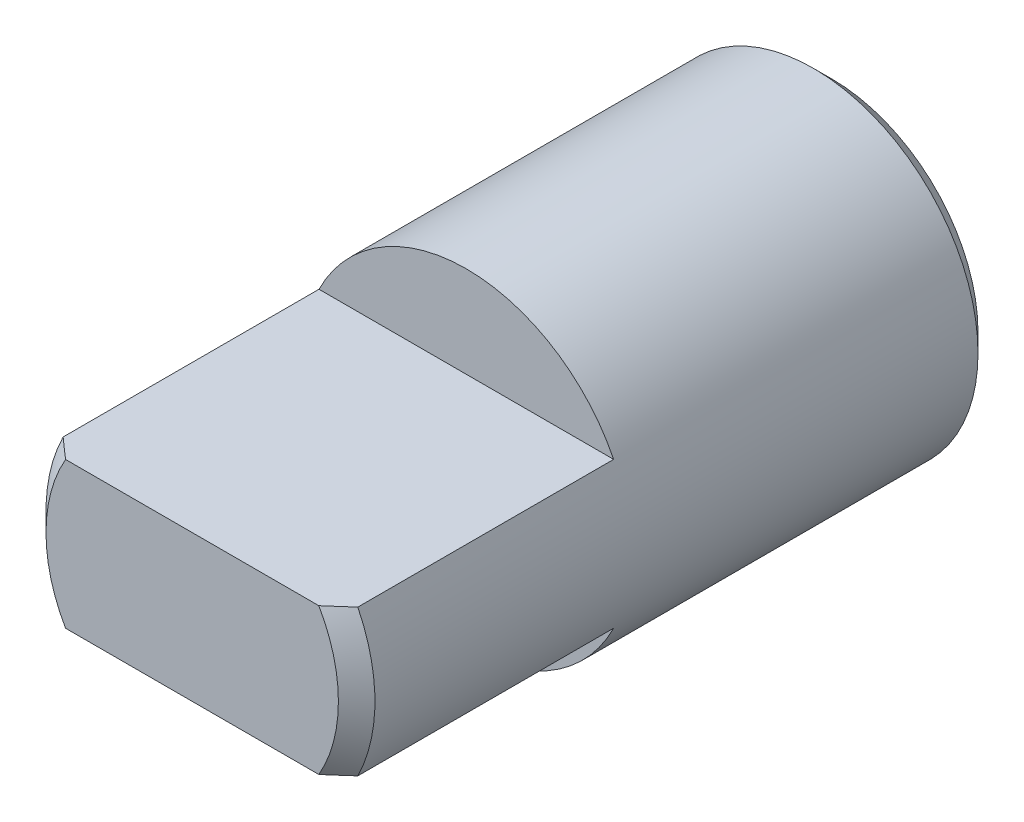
ISO-10303-21;
HEADER;
FILE_DESCRIPTION(('STEP AP214'),'2;1');
FILE_NAME('part.step','',(''),(''),'','','');
FILE_SCHEMA(('AUTOMOTIVE_DESIGN { 1 0 10303 214 1 1 1 1 }'));
ENDSEC;
DATA;
#1=APPLICATION_CONTEXT('core data for automotive mechanical design processes');
#2=APPLICATION_PROTOCOL_DEFINITION('international standard','automotive_design',2000,#1);
#3=PRODUCT_CONTEXT('',#1,'mechanical');
#4=PRODUCT('Part','Part','',(#3));
#5=PRODUCT_RELATED_PRODUCT_CATEGORY('part','',(#4));
#6=PRODUCT_DEFINITION_FORMATION('','',#4);
#7=PRODUCT_DEFINITION_CONTEXT('part definition',#1,'design');
#8=PRODUCT_DEFINITION('design','',#6,#7);
#9=PRODUCT_DEFINITION_SHAPE('','',#8);
#10=(LENGTH_UNIT() NAMED_UNIT(*) SI_UNIT(.MILLI.,.METRE.));
#11=(NAMED_UNIT(*) PLANE_ANGLE_UNIT() SI_UNIT($,.RADIAN.));
#12=(NAMED_UNIT(*) SI_UNIT($,.STERADIAN.) SOLID_ANGLE_UNIT());
#13=UNCERTAINTY_MEASURE_WITH_UNIT(LENGTH_MEASURE(1.E-05),#10,'distance_accuracy_value','');
#14=(GEOMETRIC_REPRESENTATION_CONTEXT(3) GLOBAL_UNCERTAINTY_ASSIGNED_CONTEXT((#13)) GLOBAL_UNIT_ASSIGNED_CONTEXT((#10,
#11,#12)) REPRESENTATION_CONTEXT('',''));
#15=CARTESIAN_POINT('',(0.,0.,0.));
#16=DIRECTION('',(0.,0.,1.));
#17=DIRECTION('',(1.,0.,0.));
#18=AXIS2_PLACEMENT_3D('',#15,#16,#17);
#19=CARTESIAN_POINT('',(0.,0.,35.));
#20=DIRECTION('',(0.,0.,-1.));
#21=DIRECTION('',(-1.,0.,0.));
#22=AXIS2_PLACEMENT_3D('',#19,#20,#21);
#23=CONICAL_SURFACE('',#22,8.,0.785398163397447);
#24=CARTESIAN_POINT('',(19.4089591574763,-4.,23.183146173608));
#25=CARTESIAN_POINT('',(18.9353345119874,-4.,23.6470001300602));
#26=CARTESIAN_POINT('',(18.4613845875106,-4.,24.1105227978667));
#27=CARTESIAN_POINT('',(17.5118303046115,-4.,25.0374462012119));
#28=CARTESIAN_POINT('',(17.0362245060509,-4.,25.5008454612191));
#29=CARTESIAN_POINT('',(16.0705869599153,-4.,26.4394869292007));
#30=CARTESIAN_POINT('',(15.5805242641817,-4.,26.9146973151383));
#31=CARTESIAN_POINT('',(14.5997118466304,-4.,27.8627683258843));
#32=CARTESIAN_POINT('',(14.1089646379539,-4.,28.3356315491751));
#33=CARTESIAN_POINT('',(13.153671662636,-4.,29.2522006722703));
#34=CARTESIAN_POINT('',(12.6892377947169,-4.,29.6960230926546));
#35=CARTESIAN_POINT('',(11.7578582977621,-4.,30.5812144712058));
#36=CARTESIAN_POINT('',(11.2909121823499,-4.,31.0225829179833));
#37=CARTESIAN_POINT('',(10.3504634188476,-4.,31.9047246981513));
#38=CARTESIAN_POINT('',(9.87693777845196,-4.,32.3454735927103));
#39=CARTESIAN_POINT('',(9.16306908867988,-4.,33.0023366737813));
#40=CARTESIAN_POINT('',(8.9246094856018,-4.,33.2204970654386));
#41=CARTESIAN_POINT('',(8.44613313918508,-4.,33.6551023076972));
#42=CARTESIAN_POINT('',(8.20611640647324,-4.,33.8715471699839));
#43=CARTESIAN_POINT('',(7.7305774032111,-4.,34.2965095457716));
#44=CARTESIAN_POINT('',(7.49510639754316,-4.,34.5050843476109));
#45=CARTESIAN_POINT('',(7.02182513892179,-4.,34.9195935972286));
#46=CARTESIAN_POINT('',(6.78401475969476,-4.,35.125527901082));
#47=CARTESIAN_POINT('',(6.30466284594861,-4.,35.5345411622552));
#48=CARTESIAN_POINT('',(6.06311201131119,-4.,35.7376092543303));
#49=CARTESIAN_POINT('',(5.57611628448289,-4.,36.1389479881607));
#50=CARTESIAN_POINT('',(5.33067207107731,-4.,36.3372194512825));
#51=CARTESIAN_POINT('',(4.83783493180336,-4.,36.7245220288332));
#52=CARTESIAN_POINT('',(4.59051185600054,-4.,36.9136412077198));
#53=CARTESIAN_POINT('',(4.21420782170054,-4.,37.1903200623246));
#54=CARTESIAN_POINT('',(4.08782984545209,-4.,37.281418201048));
#55=CARTESIAN_POINT('',(3.8330258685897,-4.,37.46069766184));
#56=CARTESIAN_POINT('',(3.70459999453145,-4.,37.5488791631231));
#57=CARTESIAN_POINT('',(3.44603476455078,-4.,37.7211824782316));
#58=CARTESIAN_POINT('',(3.31590823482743,-4.,37.80532347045));
#59=CARTESIAN_POINT('',(3.05284758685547,-4.,37.9691667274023));
#60=CARTESIAN_POINT('',(2.91991306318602,-4.,38.0488683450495));
#61=CARTESIAN_POINT('',(2.65102768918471,-4.,38.2025224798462));
#62=CARTESIAN_POINT('',(2.51508198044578,-4.,38.2764839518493));
#63=CARTESIAN_POINT('',(2.23955550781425,-4.,38.4172505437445));
#64=CARTESIAN_POINT('',(2.09997643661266,-4.,38.4840589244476));
#65=CARTESIAN_POINT('',(1.92815960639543,-4.,38.5596099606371));
#66=CARTESIAN_POINT('',(1.89781604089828,-4.,38.5727044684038));
#67=CARTESIAN_POINT('',(1.83693812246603,-4.,38.5984570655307));
#68=CARTESIAN_POINT('',(1.80640373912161,-4.,38.6111150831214));
#69=CARTESIAN_POINT('',(1.71449885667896,-4.,38.6484060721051));
#70=CARTESIAN_POINT('',(1.65284580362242,-4.,38.6723475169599));
#71=CARTESIAN_POINT('',(1.52879041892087,-4.,38.7181920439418));
#72=CARTESIAN_POINT('',(1.46638815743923,-4.00000000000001,38.7400953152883));
#73=CARTESIAN_POINT('',(1.34084901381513,-4.00000000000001,38.7816630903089));
#74=CARTESIAN_POINT('',(1.27771217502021,-4.00000000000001,38.801327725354));
#75=CARTESIAN_POINT('',(1.08935320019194,-4.00000000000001,38.8560368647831));
#76=CARTESIAN_POINT('',(0.9630841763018,-4.00000000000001,38.8875840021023));
#77=CARTESIAN_POINT('',(0.708234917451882,-4.00000000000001,38.9396987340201));
#78=CARTESIAN_POINT('',(0.579653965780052,-4.00000000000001,38.9602628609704));
#79=CARTESIAN_POINT('',(0.31866083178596,-4.00000000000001,38.9894598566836));
#80=CARTESIAN_POINT('',(0.186222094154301,-4.00000000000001,38.9978608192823));
#81=CARTESIAN_POINT('',(-0.0787934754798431,-4.00000000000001,39.0014179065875));
#82=CARTESIAN_POINT('',(-0.21137025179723,-4.00000000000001,38.9965781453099));
#83=CARTESIAN_POINT('',(-0.475734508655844,-4.00000000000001,38.973969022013));
#84=CARTESIAN_POINT('',(-0.607519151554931,-4.00000000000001,38.9561670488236));
#85=CARTESIAN_POINT('',(-0.86894476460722,-4.00000000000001,38.9087271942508));
#86=CARTESIAN_POINT('',(-0.998584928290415,-4.00000000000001,38.8790849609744));
#87=CARTESIAN_POINT('',(-1.30425823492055,-4.00000000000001,38.7962024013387));
#88=CARTESIAN_POINT('',(-1.47901284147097,-4.,38.7382716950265));
#89=CARTESIAN_POINT('',(-1.82266913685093,-4.,38.6071859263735));
#90=CARTESIAN_POINT('',(-1.99156732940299,-4.,38.5340219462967));
#91=CARTESIAN_POINT('',(-2.32488487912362,-4.,38.3757768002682));
#92=CARTESIAN_POINT('',(-2.48927059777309,-4.,38.2906256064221));
#93=CARTESIAN_POINT('',(-2.73217701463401,-4.,38.1564210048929));
#94=CARTESIAN_POINT('',(-2.81252399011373,-4.,38.1106126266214));
#95=CARTESIAN_POINT('',(-2.97210704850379,-4.,38.0171051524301));
#96=CARTESIAN_POINT('',(-3.05134317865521,-4.,37.9694061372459));
#97=CARTESIAN_POINT('',(-3.31169396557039,-4.,37.8089691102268));
#98=CARTESIAN_POINT('',(-3.49063128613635,-4.,37.6926941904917));
#99=CARTESIAN_POINT('',(-3.84419975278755,-4.,37.453746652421));
#100=CARTESIAN_POINT('',(-4.01882980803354,-4.,37.3310724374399));
#101=CARTESIAN_POINT('',(-4.36475212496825,-4.,37.0808109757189));
#102=CARTESIAN_POINT('',(-4.53604135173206,-4.,36.9532195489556));
#103=CARTESIAN_POINT('',(-4.87577992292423,-4.,36.694356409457));
#104=CARTESIAN_POINT('',(-5.04422952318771,-4.,36.563085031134));
#105=CARTESIAN_POINT('',(-5.37930082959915,-4.,36.2972808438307));
#106=CARTESIAN_POINT('',(-5.54591608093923,-4.,36.1627399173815));
#107=CARTESIAN_POINT('',(-5.87724856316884,-4.,35.8913398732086));
#108=CARTESIAN_POINT('',(-6.04196575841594,-4.,35.7544807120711));
#109=CARTESIAN_POINT('',(-6.53361332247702,-4.,35.341253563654));
#110=CARTESIAN_POINT('',(-6.85820438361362,-4.,35.0621037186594));
#111=CARTESIAN_POINT('',(-7.50407433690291,-4.,34.4978521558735));
#112=CARTESIAN_POINT('',(-7.82533841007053,-4.,34.2127335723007));
#113=CARTESIAN_POINT('',(-8.46466906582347,-4.,33.6388686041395));
#114=CARTESIAN_POINT('',(-8.78273529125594,-4.,33.3501218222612));
#115=CARTESIAN_POINT('',(-9.41591948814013,-4.,32.7704658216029));
#116=CARTESIAN_POINT('',(-9.7310414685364,-4.,32.4795609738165));
#117=CARTESIAN_POINT('',(-10.3594299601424,-4.,31.8957530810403));
#118=CARTESIAN_POINT('',(-10.6726964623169,-4.,31.6028500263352));
#119=CARTESIAN_POINT('',(-11.342575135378,-4.,30.9734025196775));
#120=CARTESIAN_POINT('',(-11.6989640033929,-4.,30.6366205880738));
#121=CARTESIAN_POINT('',(-12.4102727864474,-4.,29.9615035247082));
#122=CARTESIAN_POINT('',(-12.7651926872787,-4.,29.6231683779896));
#123=CARTESIAN_POINT('',(-13.8286228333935,-4.,28.6059837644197));
#124=CARTESIAN_POINT('',(-14.5354065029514,-4.,27.9253297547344));
#125=CARTESIAN_POINT('',(-15.9379694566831,-4.,26.5686925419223));
#126=CARTESIAN_POINT('',(-16.6337825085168,-4.,25.8927441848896));
#127=CARTESIAN_POINT('',(-17.6757668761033,-4.,24.8774535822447));
#128=CARTESIAN_POINT('',(-18.0227031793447,-4.,24.5388959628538));
#129=CARTESIAN_POINT('',(-18.7161396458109,-4.,23.8613357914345));
#130=CARTESIAN_POINT('',(-19.0626398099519,-4.,23.5223332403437));
#131=CARTESIAN_POINT('',(-19.4089591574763,-4.,23.183146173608));
#132=B_SPLINE_CURVE_WITH_KNOTS('',3,(#24,#25,#26,#27,#28,#29,#30,#31,#32,#33,#34,#35,#36,#37,
#38,#39,#40,#41,#42,#43,#44,#45,#46,#47,#48,#49,#50,#51,#52,#53,#54,#55,#56,#57,#58,#59,#60,#61,
#62,#63,#64,#65,#66,#67,#68,#69,#70,#71,#72,#73,#74,#75,#76,#77,#78,#79,#80,#81,#82,#83,#84,#85,
#86,#87,#88,#89,#90,#91,#92,#93,#94,#95,#96,#97,#98,#99,#100,#101,#102,#103,#104,#105,#106,#107,
#108,#109,#110,#111,#112,#113,#114,#115,#116,#117,#118,#119,#120,#121,#122,#123,#124,#125,#126,
#127,#128,#129,#130,#131),.UNSPECIFIED.,.F.,.F.,(4,2,2,2,2,2,2,2,2,2,2,2,2,2,2,2,2,2,2,2,2,2,2,
2,2,2,2,2,2,2,2,2,2,2,2,2,2,2,2,2,2,2,2,2,2,2,2,2,2,2,2,2,2,4),(0.,1.98880115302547,
3.98089873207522,6.02879192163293,8.07326594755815,10.0004572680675,11.9280361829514,
13.8687177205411,14.8383054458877,15.8078865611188,16.7515610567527,17.6952867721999,
18.6419459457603,19.5884418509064,20.522291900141,20.989627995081,21.4569353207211,
21.9217450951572,22.3866224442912,22.8507593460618,23.3146837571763,23.4138267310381,
23.512985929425,23.7113671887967,23.9097300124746,24.1080811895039,24.4980759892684,
24.8881938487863,25.2856560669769,25.6829948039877,26.0813366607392,26.4798250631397,
27.0311621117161,27.5828228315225,28.137851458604,28.4152964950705,28.6927296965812,
29.3327088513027,29.9728484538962,30.6135447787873,31.2541830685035,31.8966188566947,
32.5390666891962,33.8233289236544,35.1119122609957,36.4006379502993,37.6872302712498,
38.973828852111,40.4448480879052,41.9158815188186,44.8595859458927,47.7698312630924,
49.2240917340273,50.6783491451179),.UNSPECIFIED.);
#133=CARTESIAN_POINT('',(8.06225774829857,-4.,34.));
#134=VERTEX_POINT('',#133);
#135=CARTESIAN_POINT('',(6.92820323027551,-4.,35.));
#136=VERTEX_POINT('',#135);
#137=EDGE_CURVE('E39',#134,#136,#132,.T.);
#138=ORIENTED_EDGE('',*,*,#137,.F.);
#139=CARTESIAN_POINT('',(0.,0.,34.));
#140=DIRECTION('',(0.,0.,1.));
#141=DIRECTION('',(1.,0.,0.));
#142=AXIS2_PLACEMENT_3D('',#139,#140,#141);
#143=CIRCLE('',#142,9.);
#144=CARTESIAN_POINT('',(8.06225774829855,4.,34.));
#145=VERTEX_POINT('',#144);
#146=EDGE_CURVE('E110',#145,#134,#143,.F.);
#147=ORIENTED_EDGE('',*,*,#146,.F.);
#148=CARTESIAN_POINT('',(-19.4089591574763,4.,23.183146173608));
#149=CARTESIAN_POINT('',(-18.9353345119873,4.,23.6470001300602));
#150=CARTESIAN_POINT('',(-18.4613845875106,4.,24.1105227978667));
#151=CARTESIAN_POINT('',(-17.5118303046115,4.,25.0374462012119));
#152=CARTESIAN_POINT('',(-17.0362245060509,4.,25.5008454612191));
#153=CARTESIAN_POINT('',(-16.0705869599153,4.,26.4394869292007));
#154=CARTESIAN_POINT('',(-15.5805242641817,4.,26.9146973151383));
#155=CARTESIAN_POINT('',(-14.5997118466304,4.,27.8627683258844));
#156=CARTESIAN_POINT('',(-14.1089646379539,4.,28.3356315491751));
#157=CARTESIAN_POINT('',(-13.153671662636,4.,29.2522006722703));
#158=CARTESIAN_POINT('',(-12.6892377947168,4.,29.6960230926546));
#159=CARTESIAN_POINT('',(-11.7578582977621,4.,30.5812144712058));
#160=CARTESIAN_POINT('',(-11.2909121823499,4.,31.0225829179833));
#161=CARTESIAN_POINT('',(-10.3504634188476,4.,31.9047246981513));
#162=CARTESIAN_POINT('',(-9.87693777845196,4.,32.3454735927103));
#163=CARTESIAN_POINT('',(-9.16306908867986,4.,33.0023366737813));
#164=CARTESIAN_POINT('',(-8.92460948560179,4.,33.2204970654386));
#165=CARTESIAN_POINT('',(-8.44613313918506,4.,33.6551023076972));
#166=CARTESIAN_POINT('',(-8.20611640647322,4.,33.871547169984));
#167=CARTESIAN_POINT('',(-7.73057740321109,4.,34.2965095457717));
#168=CARTESIAN_POINT('',(-7.49510639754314,4.,34.5050843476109));
#169=CARTESIAN_POINT('',(-7.02182513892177,4.,34.9195935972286));
#170=CARTESIAN_POINT('',(-6.78401475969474,4.,35.1255279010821));
#171=CARTESIAN_POINT('',(-6.30466284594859,4.,35.5345411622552));
#172=CARTESIAN_POINT('',(-6.06311201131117,4.,35.7376092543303));
#173=CARTESIAN_POINT('',(-5.57611628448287,4.,36.1389479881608));
#174=CARTESIAN_POINT('',(-5.33067207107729,4.,36.3372194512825));
#175=CARTESIAN_POINT('',(-4.83783493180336,4.,36.7245220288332));
#176=CARTESIAN_POINT('',(-4.59051185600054,4.,36.9136412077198));
#177=CARTESIAN_POINT('',(-4.21420782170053,4.,37.1903200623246));
#178=CARTESIAN_POINT('',(-4.08782984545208,4.,37.281418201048));
#179=CARTESIAN_POINT('',(-3.83302586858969,4.,37.46069766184));
#180=CARTESIAN_POINT('',(-3.70459999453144,4.,37.5488791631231));
#181=CARTESIAN_POINT('',(-3.44603476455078,4.,37.7211824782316));
#182=CARTESIAN_POINT('',(-3.31590823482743,4.,37.80532347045));
#183=CARTESIAN_POINT('',(-3.05284758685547,4.,37.9691667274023));
#184=CARTESIAN_POINT('',(-2.91991306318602,4.,38.0488683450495));
#185=CARTESIAN_POINT('',(-2.65102768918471,4.,38.2025224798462));
#186=CARTESIAN_POINT('',(-2.51508198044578,4.,38.2764839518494));
#187=CARTESIAN_POINT('',(-2.23955550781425,4.,38.4172505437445));
#188=CARTESIAN_POINT('',(-2.09997643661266,4.,38.4840589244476));
#189=CARTESIAN_POINT('',(-1.92815960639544,4.,38.5596099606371));
#190=CARTESIAN_POINT('',(-1.89781604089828,4.,38.5727044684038));
#191=CARTESIAN_POINT('',(-1.83693812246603,4.,38.5984570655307));
#192=CARTESIAN_POINT('',(-1.80640373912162,4.,38.6111150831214));
#193=CARTESIAN_POINT('',(-1.71449885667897,4.,38.6484060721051));
#194=CARTESIAN_POINT('',(-1.65284580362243,4.,38.6723475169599));
#195=CARTESIAN_POINT('',(-1.52879041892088,4.,38.7181920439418));
#196=CARTESIAN_POINT('',(-1.46638815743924,3.99999999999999,38.7400953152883));
#197=CARTESIAN_POINT('',(-1.34084901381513,3.99999999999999,38.7816630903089));
#198=CARTESIAN_POINT('',(-1.27771217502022,3.99999999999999,38.801327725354));
#199=CARTESIAN_POINT('',(-1.08935320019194,3.99999999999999,38.8560368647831));
#200=CARTESIAN_POINT('',(-0.963084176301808,3.99999999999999,38.8875840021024));
#201=CARTESIAN_POINT('',(-0.708234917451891,3.99999999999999,38.9396987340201));
#202=CARTESIAN_POINT('',(-0.579653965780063,3.99999999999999,38.9602628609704));
#203=CARTESIAN_POINT('',(-0.318660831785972,3.99999999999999,38.9894598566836));
#204=CARTESIAN_POINT('',(-0.186222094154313,3.99999999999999,38.9978608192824));
#205=CARTESIAN_POINT('',(0.0787934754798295,3.99999999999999,39.0014179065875));
#206=CARTESIAN_POINT('',(0.211370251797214,3.99999999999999,38.9965781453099));
#207=CARTESIAN_POINT('',(0.475734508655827,3.99999999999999,38.9739690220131));
#208=CARTESIAN_POINT('',(0.607519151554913,3.99999999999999,38.9561670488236));
#209=CARTESIAN_POINT('',(0.868944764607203,3.99999999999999,38.9087271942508));
#210=CARTESIAN_POINT('',(0.998584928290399,3.99999999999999,38.8790849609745));
#211=CARTESIAN_POINT('',(1.30425823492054,3.99999999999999,38.7962024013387));
#212=CARTESIAN_POINT('',(1.47901284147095,4.,38.7382716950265));
#213=CARTESIAN_POINT('',(1.82266913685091,4.,38.6071859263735));
#214=CARTESIAN_POINT('',(1.99156732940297,4.,38.5340219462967));
#215=CARTESIAN_POINT('',(2.32488487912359,4.,38.3757768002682));
#216=CARTESIAN_POINT('',(2.48927059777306,4.,38.2906256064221));
#217=CARTESIAN_POINT('',(2.73217701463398,4.,38.1564210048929));
#218=CARTESIAN_POINT('',(2.8125239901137,4.,38.1106126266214));
#219=CARTESIAN_POINT('',(2.97210704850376,4.,38.0171051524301));
#220=CARTESIAN_POINT('',(3.05134317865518,4.,37.9694061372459));
#221=CARTESIAN_POINT('',(3.31169396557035,4.,37.8089691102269));
#222=CARTESIAN_POINT('',(3.49063128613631,4.,37.6926941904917));
#223=CARTESIAN_POINT('',(3.84419975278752,4.,37.4537466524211));
#224=CARTESIAN_POINT('',(4.0188298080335,4.,37.3310724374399));
#225=CARTESIAN_POINT('',(4.36475212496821,4.,37.0808109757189));
#226=CARTESIAN_POINT('',(4.53604135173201,4.,36.9532195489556));
#227=CARTESIAN_POINT('',(4.87577992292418,4.,36.694356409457));
#228=CARTESIAN_POINT('',(5.04422952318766,4.,36.5630850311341));
#229=CARTESIAN_POINT('',(5.37930082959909,4.,36.2972808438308));
#230=CARTESIAN_POINT('',(5.54591608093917,4.,36.1627399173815));
#231=CARTESIAN_POINT('',(5.87724856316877,4.,35.8913398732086));
#232=CARTESIAN_POINT('',(6.04196575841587,4.,35.7544807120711));
#233=CARTESIAN_POINT('',(6.53361332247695,4.,35.341253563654));
#234=CARTESIAN_POINT('',(6.85820438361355,4.,35.0621037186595));
#235=CARTESIAN_POINT('',(7.50407433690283,4.,34.4978521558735));
#236=CARTESIAN_POINT('',(7.82533841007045,4.,34.2127335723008));
#237=CARTESIAN_POINT('',(8.46466906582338,4.,33.6388686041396));
#238=CARTESIAN_POINT('',(8.78273529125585,4.,33.3501218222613));
#239=CARTESIAN_POINT('',(9.41591948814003,4.,32.770465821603));
#240=CARTESIAN_POINT('',(9.73104146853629,4.,32.4795609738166));
#241=CARTESIAN_POINT('',(10.3594299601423,4.,31.8957530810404));
#242=CARTESIAN_POINT('',(10.6726964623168,4.,31.6028500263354));
#243=CARTESIAN_POINT('',(11.3425751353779,4.,30.9734025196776));
#244=CARTESIAN_POINT('',(11.6989640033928,4.,30.6366205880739));
#245=CARTESIAN_POINT('',(12.4102727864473,4.,29.9615035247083));
#246=CARTESIAN_POINT('',(12.7651926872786,4.,29.6231683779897));
#247=CARTESIAN_POINT('',(13.8286228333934,4.,28.6059837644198));
#248=CARTESIAN_POINT('',(14.5354065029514,4.,27.9253297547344));
#249=CARTESIAN_POINT('',(15.937969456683,4.,26.5686925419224));
#250=CARTESIAN_POINT('',(16.6337825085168,4.,25.8927441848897));
#251=CARTESIAN_POINT('',(17.6757668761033,4.,24.8774535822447));
#252=CARTESIAN_POINT('',(18.0227031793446,4.,24.5388959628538));
#253=CARTESIAN_POINT('',(18.7161396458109,4.,23.8613357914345));
#254=CARTESIAN_POINT('',(19.0626398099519,4.,23.5223332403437));
#255=CARTESIAN_POINT('',(19.4089591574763,4.,23.183146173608));
#256=B_SPLINE_CURVE_WITH_KNOTS('',3,(#148,#149,#150,#151,#152,#153,#154,#155,#156,#157,#158,
#159,#160,#161,#162,#163,#164,#165,#166,#167,#168,#169,#170,#171,#172,#173,#174,#175,#176,#177,
#178,#179,#180,#181,#182,#183,#184,#185,#186,#187,#188,#189,#190,#191,#192,#193,#194,#195,#196,
#197,#198,#199,#200,#201,#202,#203,#204,#205,#206,#207,#208,#209,#210,#211,#212,#213,#214,#215,
#216,#217,#218,#219,#220,#221,#222,#223,#224,#225,#226,#227,#228,#229,#230,#231,#232,#233,#234,
#235,#236,#237,#238,#239,#240,#241,#242,#243,#244,#245,#246,#247,#248,#249,#250,#251,#252,#253,
#254,#255),.UNSPECIFIED.,.F.,.F.,(4,2,2,2,2,2,2,2,2,2,2,2,2,2,2,2,2,2,2,2,2,2,2,2,2,2,2,2,2,2,2,
2,2,2,2,2,2,2,2,2,2,2,2,2,2,2,2,2,2,2,2,2,2,4),(0.,1.98880115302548,3.98089873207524,
6.02879192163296,8.07326594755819,10.0004572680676,11.9280361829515,13.8687177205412,
14.8383054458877,15.8078865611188,16.7515610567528,17.6952867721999,18.6419459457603,
19.5884418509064,20.522291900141,20.989627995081,21.4569353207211,21.9217450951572,
22.3866224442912,22.8507593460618,23.3146837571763,23.4138267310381,23.512985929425,
23.7113671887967,23.9097300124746,24.1080811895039,24.4980759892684,24.8881938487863,
25.2856560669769,25.6829948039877,26.0813366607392,26.4798250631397,27.0311621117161,
27.5828228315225,28.137851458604,28.4152964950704,28.6927296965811,29.3327088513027,
29.9728484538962,30.6135447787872,31.2541830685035,31.8966188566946,32.5390666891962,
33.8233289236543,35.1119122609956,36.4006379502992,37.6872302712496,38.9738288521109,
40.4448480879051,41.9158815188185,44.8595859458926,47.7698312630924,49.2240917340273,
50.6783491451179),.UNSPECIFIED.);
#257=CARTESIAN_POINT('',(6.92820323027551,4.,35.));
#258=VERTEX_POINT('',#257);
#259=EDGE_CURVE('E98',#258,#145,#256,.T.);
#260=ORIENTED_EDGE('',*,*,#259,.F.);
#261=CARTESIAN_POINT('',(0.,0.,35.));
#262=DIRECTION('',(0.,0.,1.));
#263=DIRECTION('',(1.,0.,0.));
#264=AXIS2_PLACEMENT_3D('',#261,#262,#263);
#265=CIRCLE('',#264,8.);
#266=EDGE_CURVE('E53',#136,#258,#265,.T.);
#267=ORIENTED_EDGE('',*,*,#266,.F.);
#268=EDGE_LOOP('',(#138,#147,#260,#267));
#269=FACE_BOUND('',#268,.T.);
#270=ADVANCED_FACE('F31',(#269),#23,.T.);
#271=CARTESIAN_POINT('',(0.,0.,35.));
#272=DIRECTION('',(0.,0.,-1.));
#273=DIRECTION('',(-1.,0.,0.));
#274=AXIS2_PLACEMENT_3D('',#271,#272,#273);
#275=CYLINDRICAL_SURFACE('',#274,9.);
#276=ORIENTED_EDGE('',*,*,#146,.T.);
#277=DIRECTION('',(0.,0.,-1.));
#278=VECTOR('',#277,1.);
#279=CARTESIAN_POINT('',(8.06225774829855,-4.,35.));
#280=LINE('',#279,#278);
#281=CARTESIAN_POINT('',(8.06225774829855,-4.,20.));
#282=VERTEX_POINT('',#281);
#283=EDGE_CURVE('E86',#134,#282,#280,.T.);
#284=ORIENTED_EDGE('',*,*,#283,.T.);
#285=CARTESIAN_POINT('',(0.,0.,20.));
#286=DIRECTION('',(0.,0.,-1.));
#287=DIRECTION('',(0.,1.,0.));
#288=AXIS2_PLACEMENT_3D('',#285,#286,#287);
#289=CIRCLE('',#288,9.);
#290=CARTESIAN_POINT('',(-8.06225774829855,-4.,20.));
#291=VERTEX_POINT('',#290);
#292=EDGE_CURVE('E11',#282,#291,#289,.T.);
#293=ORIENTED_EDGE('',*,*,#292,.T.);
#294=DIRECTION('',(0.,0.,-1.));
#295=VECTOR('',#294,1.);
#296=CARTESIAN_POINT('',(-8.06225774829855,-4.,35.));
#297=LINE('',#296,#295);
#298=CARTESIAN_POINT('',(-8.06225774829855,-4.,34.));
#299=VERTEX_POINT('',#298);
#300=EDGE_CURVE('E176',#291,#299,#297,.F.);
#301=ORIENTED_EDGE('',*,*,#300,.T.);
#302=CARTESIAN_POINT('',(-8.06225774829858,4.,34.));
#303=VERTEX_POINT('',#302);
#304=EDGE_CURVE('E109',#299,#303,#143,.F.);
#305=ORIENTED_EDGE('',*,*,#304,.T.);
#306=DIRECTION('',(0.,0.,-1.));
#307=VECTOR('',#306,1.);
#308=CARTESIAN_POINT('',(-8.06225774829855,4.,35.));
#309=LINE('',#308,#307);
#310=CARTESIAN_POINT('',(-8.06225774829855,4.,20.));
#311=VERTEX_POINT('',#310);
#312=EDGE_CURVE('E99',#303,#311,#309,.T.);
#313=ORIENTED_EDGE('',*,*,#312,.T.);
#314=CARTESIAN_POINT('',(0.,0.,20.));
#315=DIRECTION('',(0.,0.,-1.));
#316=DIRECTION('',(-1.,0.,0.));
#317=AXIS2_PLACEMENT_3D('',#314,#315,#316);
#318=CIRCLE('',#317,9.);
#319=CARTESIAN_POINT('',(8.06225774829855,4.,20.));
#320=VERTEX_POINT('',#319);
#321=EDGE_CURVE('E121',#311,#320,#318,.T.);
#322=ORIENTED_EDGE('',*,*,#321,.T.);
#323=DIRECTION('',(0.,0.,-1.));
#324=VECTOR('',#323,1.);
#325=CARTESIAN_POINT('',(8.06225774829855,4.,35.));
#326=LINE('',#325,#324);
#327=EDGE_CURVE('E103',#320,#145,#326,.F.);
#328=ORIENTED_EDGE('',*,*,#327,.T.);
#329=EDGE_LOOP('',(#276,#284,#293,#301,#305,#313,#322,#328));
#330=FACE_BOUND('',#329,.T.);
#331=CARTESIAN_POINT('',(0.,0.,1.));
#332=DIRECTION('',(0.,0.,1.));
#333=DIRECTION('',(1.,0.,0.));
#334=AXIS2_PLACEMENT_3D('',#331,#332,#333);
#335=CIRCLE('',#334,9.);
#336=CARTESIAN_POINT('',(9.,0.,1.));
#337=VERTEX_POINT('',#336);
#338=EDGE_CURVE('E101',#337,#337,#335,.T.);
#339=ORIENTED_EDGE('',*,*,#338,.T.);
#340=EDGE_LOOP('',(#339));
#341=FACE_BOUND('',#340,.T.);
#342=ADVANCED_FACE('F141',(#330,#341),#275,.T.);
#343=CARTESIAN_POINT('',(0.,0.,35.));
#344=DIRECTION('',(0.,0.,1.));
#345=DIRECTION('',(1.,0.,0.));
#346=AXIS2_PLACEMENT_3D('',#343,#344,#345);
#347=PLANE('',#346);
#348=DIRECTION('',(1.,0.,0.));
#349=VECTOR('',#348,1.);
#350=CARTESIAN_POINT('',(-9.,-4.,35.));
#351=LINE('',#350,#349);
#352=CARTESIAN_POINT('',(-6.92820323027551,-4.,35.));
#353=VERTEX_POINT('',#352);
#354=EDGE_CURVE('E46',#353,#136,#351,.T.);
#355=ORIENTED_EDGE('',*,*,#354,.T.);
#356=ORIENTED_EDGE('',*,*,#266,.T.);
#357=DIRECTION('',(1.,0.,0.));
#358=VECTOR('',#357,1.);
#359=CARTESIAN_POINT('',(-9.,4.,35.));
#360=LINE('',#359,#358);
#361=CARTESIAN_POINT('',(-6.92820323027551,4.,35.));
#362=VERTEX_POINT('',#361);
#363=EDGE_CURVE('E170',#362,#258,#360,.T.);
#364=ORIENTED_EDGE('',*,*,#363,.F.);
#365=EDGE_CURVE('E94',#362,#353,#265,.T.);
#366=ORIENTED_EDGE('',*,*,#365,.T.);
#367=EDGE_LOOP('',(#355,#356,#364,#366));
#368=FACE_BOUND('',#367,.T.);
#369=ADVANCED_FACE('F92',(#368),#347,.T.);
#370=CARTESIAN_POINT('',(0.,0.,0.));
#371=DIRECTION('',(0.,0.,1.));
#372=DIRECTION('',(1.,0.,0.));
#373=AXIS2_PLACEMENT_3D('',#370,#371,#372);
#374=PLANE('',#373);
#375=CARTESIAN_POINT('',(0.,0.,0.));
#376=DIRECTION('',(0.,0.,1.));
#377=DIRECTION('',(1.,0.,0.));
#378=AXIS2_PLACEMENT_3D('',#375,#376,#377);
#379=CIRCLE('',#378,8.);
#380=CARTESIAN_POINT('',(8.,0.,0.));
#381=VERTEX_POINT('',#380);
#382=EDGE_CURVE('E112',#381,#381,#379,.F.);
#383=ORIENTED_EDGE('',*,*,#382,.T.);
#384=EDGE_LOOP('',(#383));
#385=FACE_BOUND('',#384,.T.);
#386=ADVANCED_FACE('F140',(#385),#374,.F.);
#387=EDGE_CURVE('E90',#353,#299,#132,.T.);
#388=ORIENTED_EDGE('',*,*,#387,.F.);
#389=ORIENTED_EDGE('',*,*,#365,.F.);
#390=EDGE_CURVE('E120',#303,#362,#256,.T.);
#391=ORIENTED_EDGE('',*,*,#390,.F.);
#392=ORIENTED_EDGE('',*,*,#304,.F.);
#393=EDGE_LOOP('',(#388,#389,#391,#392));
#394=FACE_BOUND('',#393,.T.);
#395=ADVANCED_FACE('F122',(#394),#23,.T.);
#396=CARTESIAN_POINT('',(0.,0.,1.));
#397=DIRECTION('',(0.,0.,1.));
#398=DIRECTION('',(1.,0.,0.));
#399=AXIS2_PLACEMENT_3D('',#396,#397,#398);
#400=CONICAL_SURFACE('',#399,9.,0.785398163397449);
#401=ORIENTED_EDGE('',*,*,#382,.F.);
#402=EDGE_LOOP('',(#401));
#403=FACE_BOUND('',#402,.T.);
#404=ORIENTED_EDGE('',*,*,#338,.F.);
#405=EDGE_LOOP('',(#404));
#406=FACE_BOUND('',#405,.T.);
#407=ADVANCED_FACE('F33',(#403,#406),#400,.T.);
#408=CARTESIAN_POINT('',(-9.,4.,20.));
#409=DIRECTION('',(0.,0.,-1.));
#410=DIRECTION('',(-1.,0.,0.));
#411=AXIS2_PLACEMENT_3D('',#408,#409,#410);
#412=PLANE('',#411);
#413=DIRECTION('',(1.,0.,0.));
#414=VECTOR('',#413,1.);
#415=CARTESIAN_POINT('',(-9.,4.,20.));
#416=LINE('',#415,#414);
#417=EDGE_CURVE('E172',#311,#320,#416,.T.);
#418=ORIENTED_EDGE('',*,*,#417,.T.);
#419=ORIENTED_EDGE('',*,*,#321,.F.);
#420=EDGE_LOOP('',(#418,#419));
#421=FACE_BOUND('',#420,.T.);
#422=ADVANCED_FACE('F131',(#421),#412,.F.);
#423=CARTESIAN_POINT('',(-9.,4.,20.));
#424=DIRECTION('',(0.,-1.,0.));
#425=DIRECTION('',(0.,0.,-1.));
#426=AXIS2_PLACEMENT_3D('',#423,#424,#425);
#427=PLANE('',#426);
#428=ORIENTED_EDGE('',*,*,#390,.T.);
#429=ORIENTED_EDGE('',*,*,#363,.T.);
#430=ORIENTED_EDGE('',*,*,#259,.T.);
#431=ORIENTED_EDGE('',*,*,#327,.F.);
#432=ORIENTED_EDGE('',*,*,#417,.F.);
#433=ORIENTED_EDGE('',*,*,#312,.F.);
#434=EDGE_LOOP('',(#428,#429,#430,#431,#432,#433));
#435=FACE_BOUND('',#434,.T.);
#436=ADVANCED_FACE('F125',(#435),#427,.F.);
#437=CARTESIAN_POINT('',(-9.,-4.,20.));
#438=DIRECTION('',(0.,0.,-1.));
#439=DIRECTION('',(0.,1.,0.));
#440=AXIS2_PLACEMENT_3D('',#437,#438,#439);
#441=PLANE('',#440);
#442=DIRECTION('',(1.,0.,0.));
#443=VECTOR('',#442,1.);
#444=CARTESIAN_POINT('',(-9.,-4.,20.));
#445=LINE('',#444,#443);
#446=EDGE_CURVE('E95',#291,#282,#445,.T.);
#447=ORIENTED_EDGE('',*,*,#446,.F.);
#448=ORIENTED_EDGE('',*,*,#292,.F.);
#449=EDGE_LOOP('',(#447,#448));
#450=FACE_BOUND('',#449,.T.);
#451=ADVANCED_FACE('F130',(#450),#441,.F.);
#452=CARTESIAN_POINT('',(-9.,-4.,20.));
#453=DIRECTION('',(0.,1.,0.));
#454=DIRECTION('',(0.,0.,1.));
#455=AXIS2_PLACEMENT_3D('',#452,#453,#454);
#456=PLANE('',#455);
#457=ORIENTED_EDGE('',*,*,#137,.T.);
#458=ORIENTED_EDGE('',*,*,#354,.F.);
#459=ORIENTED_EDGE('',*,*,#387,.T.);
#460=ORIENTED_EDGE('',*,*,#300,.F.);
#461=ORIENTED_EDGE('',*,*,#446,.T.);
#462=ORIENTED_EDGE('',*,*,#283,.F.);
#463=EDGE_LOOP('',(#457,#458,#459,#460,#461,#462));
#464=FACE_BOUND('',#463,.T.);
#465=ADVANCED_FACE('F83',(#464),#456,.F.);
#466=CLOSED_SHELL('',(#270,#342,#369,#386,#395,#407,#422,#436,#451,#465));
#467=MANIFOLD_SOLID_BREP('B2',#466);
#468=ADVANCED_BREP_SHAPE_REPRESENTATION('',(#18,#467),#14);
#469=SHAPE_DEFINITION_REPRESENTATION(#9,#468);
ENDSEC;
END-ISO-10303-21;
